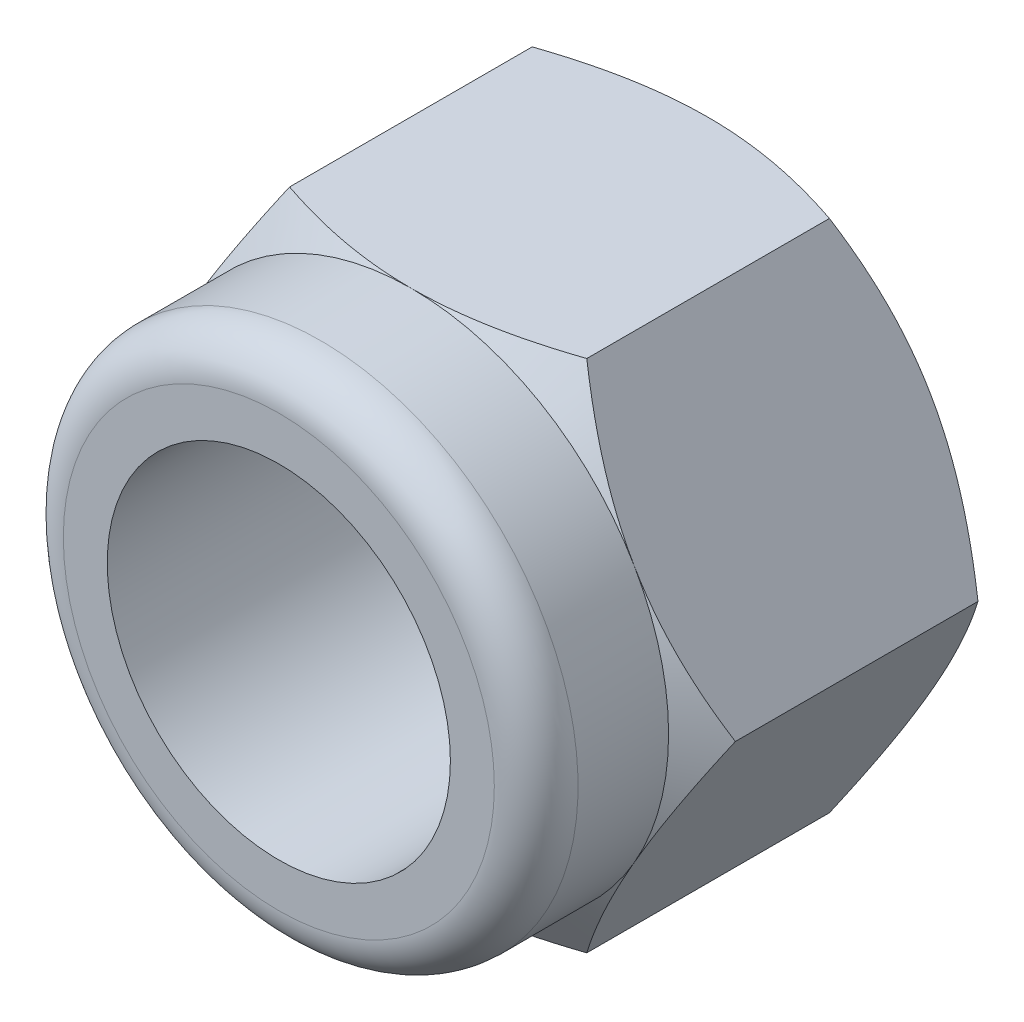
ISO-10303-21;
HEADER;
FILE_DESCRIPTION(('STEP AP214'),'2;1');
FILE_NAME('part.step','',(''),(''),'','','');
FILE_SCHEMA(('AUTOMOTIVE_DESIGN { 1 0 10303 214 1 1 1 1 }'));
ENDSEC;
DATA;
#1=APPLICATION_CONTEXT('core data for automotive mechanical design processes');
#2=APPLICATION_PROTOCOL_DEFINITION('international standard','automotive_design',2000,#1);
#3=PRODUCT_CONTEXT('',#1,'mechanical');
#4=PRODUCT('Part','Part','',(#3));
#5=PRODUCT_RELATED_PRODUCT_CATEGORY('part','',(#4));
#6=PRODUCT_DEFINITION_FORMATION('','',#4);
#7=PRODUCT_DEFINITION_CONTEXT('part definition',#1,'design');
#8=PRODUCT_DEFINITION('design','',#6,#7);
#9=PRODUCT_DEFINITION_SHAPE('','',#8);
#10=(LENGTH_UNIT() NAMED_UNIT(*) SI_UNIT(.MILLI.,.METRE.));
#11=(NAMED_UNIT(*) PLANE_ANGLE_UNIT() SI_UNIT($,.RADIAN.));
#12=(NAMED_UNIT(*) SI_UNIT($,.STERADIAN.) SOLID_ANGLE_UNIT());
#13=UNCERTAINTY_MEASURE_WITH_UNIT(LENGTH_MEASURE(1.E-05),#10,'distance_accuracy_value','');
#14=(GEOMETRIC_REPRESENTATION_CONTEXT(3) GLOBAL_UNCERTAINTY_ASSIGNED_CONTEXT((#13)) GLOBAL_UNIT_ASSIGNED_CONTEXT((#10,
#11,#12)) REPRESENTATION_CONTEXT('',''));
#15=CARTESIAN_POINT('',(0.,0.,0.));
#16=DIRECTION('',(0.,0.,1.));
#17=DIRECTION('',(1.,0.,0.));
#18=AXIS2_PLACEMENT_3D('',#15,#16,#17);
#19=CARTESIAN_POINT('',(-10.3923048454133,0.,10.37));
#20=DIRECTION('',(0.86602540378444,-0.499999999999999,0.));
#21=DIRECTION('',(0.499999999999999,0.86602540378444,0.));
#22=AXIS2_PLACEMENT_3D('',#19,#20,#21);
#23=PLANE('',#22);
#24=CARTESIAN_POINT('',(-10.3924203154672,-0.000200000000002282,9.42719454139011));
#25=CARTESIAN_POINT('',(-10.2764029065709,0.200748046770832,9.5057421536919));
#26=CARTESIAN_POINT('',(-10.1597703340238,0.402761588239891,9.58078081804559));
#27=CARTESIAN_POINT('',(-9.92519945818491,0.809050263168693,9.72275951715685));
#28=CARTESIAN_POINT('',(-9.80726035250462,1.01332678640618,9.78969423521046));
#29=CARTESIAN_POINT('',(-9.56974021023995,1.42472374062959,9.91449543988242));
#30=CARTESIAN_POINT('',(-9.45015489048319,1.63185159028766,9.97232958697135));
#31=CARTESIAN_POINT('',(-9.20985935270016,2.04805567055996,10.0774315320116));
#32=CARTESIAN_POINT('',(-9.08914949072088,2.25713128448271,10.1247025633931));
#33=CARTESIAN_POINT('',(-8.85083681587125,2.66990094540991,10.2061503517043));
#34=CARTESIAN_POINT('',(-8.73326753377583,2.87353691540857,10.2407169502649));
#35=CARTESIAN_POINT('',(-8.49740229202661,3.28206749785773,10.2980508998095));
#36=CARTESIAN_POINT('',(-8.37910631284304,3.4869621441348,10.3208179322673));
#37=CARTESIAN_POINT('',(-8.14228994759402,3.89714012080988,10.3538759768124));
#38=CARTESIAN_POINT('',(-8.02377034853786,4.10242208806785,10.3641893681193));
#39=CARTESIAN_POINT('',(-7.78662856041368,4.51316371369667,10.3721053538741));
#40=CARTESIAN_POINT('',(-7.66800637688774,4.71862336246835,10.3697085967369));
#41=CARTESIAN_POINT('',(-7.45072742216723,5.09496155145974,10.353732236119));
#42=CARTESIAN_POINT('',(-7.3520339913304,5.2659035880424,10.3420804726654));
#43=CARTESIAN_POINT('',(-7.15498835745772,5.60719663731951,10.3102495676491));
#44=CARTESIAN_POINT('',(-7.05663618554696,5.7775475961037,10.2900696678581));
#45=CARTESIAN_POINT('',(-6.76211080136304,6.28768052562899,10.2172283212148));
#46=CARTESIAN_POINT('',(-6.56667274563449,6.62618916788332,10.1522815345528));
#47=CARTESIAN_POINT('',(-6.17303719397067,7.30798594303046,9.99174825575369));
#48=CARTESIAN_POINT('',(-5.97492949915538,7.65111853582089,9.89531098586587));
#49=CARTESIAN_POINT('',(-5.58263770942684,8.33058784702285,9.67812469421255));
#50=CARTESIAN_POINT('',(-5.38844426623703,8.66694075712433,9.55744375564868));
#51=CARTESIAN_POINT('',(-5.1960369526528,9.00020000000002,9.42719454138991));
#52=B_SPLINE_CURVE_WITH_KNOTS('',3,(#24,#25,#26,#27,#28,#29,#30,#31,#32,#33,#34,#35,#36,#37,#38,
#39,#40,#41,#42,#43,#44,#45,#46,#47,#48,#49,#50,#51),.UNSPECIFIED.,.F.,.F.,(4,2,2,2,2,2,2,2,2,2,
2,2,2,4),(0.,0.734939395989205,1.47035837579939,2.20833441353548,2.94608424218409,
3.65880420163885,4.37154339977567,5.08299988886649,5.79442008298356,6.38742131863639,
6.98047528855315,8.16780437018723,9.39031146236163,10.6094322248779),.UNSPECIFIED.);
#53=CARTESIAN_POINT('',(-10.3923048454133,0.,9.42727272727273));
#54=VERTEX_POINT('',#53);
#55=CARTESIAN_POINT('',(-7.79422863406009,4.5,10.37));
#56=VERTEX_POINT('',#55);
#57=EDGE_CURVE('E142',#54,#56,#52,.T.);
#58=ORIENTED_EDGE('',*,*,#57,.T.);
#59=CARTESIAN_POINT('',(-5.19615242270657,8.99999999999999,9.42727272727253));
#60=VERTEX_POINT('',#59);
#61=EDGE_CURVE('E148',#56,#60,#52,.T.);
#62=ORIENTED_EDGE('',*,*,#61,.T.);
#63=DIRECTION('',(0.,0.,-1.));
#64=VECTOR('',#63,1.);
#65=CARTESIAN_POINT('',(-5.19615242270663,8.99999999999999,10.3699999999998));
#66=LINE('',#65,#64);
#67=CARTESIAN_POINT('',(-5.19615242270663,8.99999999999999,0.942727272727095));
#68=VERTEX_POINT('',#67);
#69=EDGE_CURVE('E232',#60,#68,#66,.T.);
#70=ORIENTED_EDGE('',*,*,#69,.T.);
#71=CARTESIAN_POINT('',(-5.1960369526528,9.00020000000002,0.942805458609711));
#72=CARTESIAN_POINT('',(-5.31205436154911,8.79925195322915,0.864257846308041));
#73=CARTESIAN_POINT('',(-5.42868693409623,8.59723841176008,0.789219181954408));
#74=CARTESIAN_POINT('',(-5.66325780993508,8.19094973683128,0.647240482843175));
#75=CARTESIAN_POINT('',(-5.78119691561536,7.9866732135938,0.580305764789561));
#76=CARTESIAN_POINT('',(-6.01871705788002,7.5752762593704,0.455504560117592));
#77=CARTESIAN_POINT('',(-6.13830237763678,7.36814840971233,0.397670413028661));
#78=CARTESIAN_POINT('',(-6.37859791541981,6.95194432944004,0.292568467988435));
#79=CARTESIAN_POINT('',(-6.49930777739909,6.74286871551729,0.245297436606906));
#80=CARTESIAN_POINT('',(-6.73762045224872,6.3300990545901,0.163849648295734));
#81=CARTESIAN_POINT('',(-6.85518973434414,6.12646308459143,0.129283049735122));
#82=CARTESIAN_POINT('',(-7.09105497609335,5.71793250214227,0.0719491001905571));
#83=CARTESIAN_POINT('',(-7.20935095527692,5.51303785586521,0.0491820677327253));
#84=CARTESIAN_POINT('',(-7.44616732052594,5.10285987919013,0.0161240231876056));
#85=CARTESIAN_POINT('',(-7.56468691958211,4.89757791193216,0.00581063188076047));
#86=CARTESIAN_POINT('',(-7.80182870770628,4.48683628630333,-0.00210535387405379));
#87=CARTESIAN_POINT('',(-7.92045089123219,4.28137663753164,0.00029140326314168));
#88=CARTESIAN_POINT('',(-8.1377298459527,3.90503844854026,0.0162677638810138));
#89=CARTESIAN_POINT('',(-8.23642327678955,3.73409641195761,0.0279195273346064));
#90=CARTESIAN_POINT('',(-8.43346891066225,3.39280336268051,0.0597504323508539));
#91=CARTESIAN_POINT('',(-8.531821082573,3.22245240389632,0.0799303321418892));
#92=CARTESIAN_POINT('',(-8.82634646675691,2.71231947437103,0.152771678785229));
#93=CARTESIAN_POINT('',(-9.02178452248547,2.3738108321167,0.217718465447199));
#94=CARTESIAN_POINT('',(-9.41542007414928,1.69201405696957,0.378251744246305));
#95=CARTESIAN_POINT('',(-9.61352776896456,1.34888146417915,0.474689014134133));
#96=CARTESIAN_POINT('',(-10.0058195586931,0.669412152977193,0.691875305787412));
#97=CARTESIAN_POINT('',(-10.2000130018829,0.33305924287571,0.81255624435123));
#98=CARTESIAN_POINT('',(-10.3924203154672,-0.000200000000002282,0.942805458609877));
#99=B_SPLINE_CURVE_WITH_KNOTS('',3,(#71,#72,#73,#74,#75,#76,#77,#78,#79,#80,#81,#82,#83,#84,#85,
#86,#87,#88,#89,#90,#91,#92,#93,#94,#95,#96,#97,#98),.UNSPECIFIED.,.F.,.F.,(4,2,2,2,2,2,2,2,2,2,
2,2,2,4),(0.,0.734939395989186,1.47035837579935,2.20833441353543,2.94608424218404,
3.65880420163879,4.37154339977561,5.08299988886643,5.79442008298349,6.38742131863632,
6.98047528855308,8.16780437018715,9.39031146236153,10.6094322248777),.UNSPECIFIED.);
#100=CARTESIAN_POINT('',(-7.79422863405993,4.49999999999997,0.));
#101=VERTEX_POINT('',#100);
#102=EDGE_CURVE('E231',#68,#101,#99,.T.);
#103=ORIENTED_EDGE('',*,*,#102,.T.);
#104=CARTESIAN_POINT('',(-10.3923048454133,0.,0.942727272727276));
#105=VERTEX_POINT('',#104);
#106=EDGE_CURVE('E225',#101,#105,#99,.T.);
#107=ORIENTED_EDGE('',*,*,#106,.T.);
#108=DIRECTION('',(0.,0.,-1.));
#109=VECTOR('',#108,1.);
#110=CARTESIAN_POINT('',(-10.3923048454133,0.,10.37));
#111=LINE('',#110,#109);
#112=EDGE_CURVE('E241',#54,#105,#111,.T.);
#113=ORIENTED_EDGE('',*,*,#112,.F.);
#114=EDGE_LOOP('',(#58,#62,#70,#103,#107,#113));
#115=FACE_BOUND('',#114,.T.);
#116=ADVANCED_FACE('F31',(#115),#23,.F.);
#117=CARTESIAN_POINT('',(-5.19615242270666,-9.00000000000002,10.3699999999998));
#118=DIRECTION('',(0.866025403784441,0.499999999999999,0.));
#119=DIRECTION('',(-0.499999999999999,0.866025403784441,0.));
#120=AXIS2_PLACEMENT_3D('',#117,#118,#119);
#121=PLANE('',#120);
#122=CARTESIAN_POINT('',(-5.19603695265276,-9.00020000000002,9.42719454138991));
#123=CARTESIAN_POINT('',(-5.31205436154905,-8.79925195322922,9.50574215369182));
#124=CARTESIAN_POINT('',(-5.42868693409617,-8.59723841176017,9.58078081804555));
#125=CARTESIAN_POINT('',(-5.66325780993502,-8.19094973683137,9.72275951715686));
#126=CARTESIAN_POINT('',(-5.7811969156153,-7.98667321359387,9.78969423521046));
#127=CARTESIAN_POINT('',(-6.01871705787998,-7.57527625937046,9.91449543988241));
#128=CARTESIAN_POINT('',(-6.13830237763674,-7.36814840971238,9.97232958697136));
#129=CARTESIAN_POINT('',(-6.37859791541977,-6.95194432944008,10.0774315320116));
#130=CARTESIAN_POINT('',(-6.49930777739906,-6.74286871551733,10.1247025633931));
#131=CARTESIAN_POINT('',(-6.73762045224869,-6.33009905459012,10.2061503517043));
#132=CARTESIAN_POINT('',(-6.85518973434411,-6.12646308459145,10.2407169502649));
#133=CARTESIAN_POINT('',(-7.09105497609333,-5.71793250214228,10.2980508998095));
#134=CARTESIAN_POINT('',(-7.20935095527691,-5.51303785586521,10.3208179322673));
#135=CARTESIAN_POINT('',(-7.44616732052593,-5.10285987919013,10.3538759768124));
#136=CARTESIAN_POINT('',(-7.5646869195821,-4.89757791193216,10.3641893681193));
#137=CARTESIAN_POINT('',(-7.80182870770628,-4.48683628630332,10.3721053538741));
#138=CARTESIAN_POINT('',(-7.9204508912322,-4.28137663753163,10.3697085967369));
#139=CARTESIAN_POINT('',(-8.13772984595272,-3.90503844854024,10.353732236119));
#140=CARTESIAN_POINT('',(-8.23642327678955,-3.73409641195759,10.3420804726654));
#141=CARTESIAN_POINT('',(-8.43346891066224,-3.39280336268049,10.3102495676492));
#142=CARTESIAN_POINT('',(-8.531821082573,-3.22245240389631,10.2900696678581));
#143=CARTESIAN_POINT('',(-8.8263464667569,-2.71231947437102,10.2172283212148));
#144=CARTESIAN_POINT('',(-9.02178452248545,-2.3738108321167,10.1522815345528));
#145=CARTESIAN_POINT('',(-9.41542007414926,-1.69201405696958,9.99174825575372));
#146=CARTESIAN_POINT('',(-9.61352776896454,-1.34888146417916,9.8953109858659));
#147=CARTESIAN_POINT('',(-10.0058195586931,-0.669412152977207,9.67812469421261));
#148=CARTESIAN_POINT('',(-10.2000130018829,-0.333059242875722,9.55744375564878));
#149=CARTESIAN_POINT('',(-10.3924203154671,0.000199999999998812,9.42719454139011));
#150=B_SPLINE_CURVE_WITH_KNOTS('',3,(#122,#123,#124,#125,#126,#127,#128,#129,#130,#131,#132,
#133,#134,#135,#136,#137,#138,#139,#140,#141,#142,#143,#144,#145,#146,#147,#148,#149),
.UNSPECIFIED.,.F.,.F.,(4,2,2,2,2,2,2,2,2,2,2,2,2,4),(0.,0.734939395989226,1.47035837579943,
2.20833441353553,2.94608424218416,3.65880420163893,4.37154339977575,5.08299988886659,
5.79442008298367,6.38742131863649,6.98047528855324,8.16780437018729,9.39031146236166,
10.6094322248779),.UNSPECIFIED.);
#151=CARTESIAN_POINT('',(-5.19615242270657,-9.00000000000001,9.42727272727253));
#152=VERTEX_POINT('',#151);
#153=CARTESIAN_POINT('',(-7.79422863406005,-4.50000000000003,10.37));
#154=VERTEX_POINT('',#153);
#155=EDGE_CURVE('E196',#152,#154,#150,.T.);
#156=ORIENTED_EDGE('',*,*,#155,.T.);
#157=EDGE_CURVE('E191',#154,#54,#150,.T.);
#158=ORIENTED_EDGE('',*,*,#157,.T.);
#159=ORIENTED_EDGE('',*,*,#112,.T.);
#160=CARTESIAN_POINT('',(-10.3924203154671,0.000199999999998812,0.942805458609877));
#161=CARTESIAN_POINT('',(-10.2764029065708,-0.200748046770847,0.864257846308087));
#162=CARTESIAN_POINT('',(-10.1597703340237,-0.402761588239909,0.789219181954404));
#163=CARTESIAN_POINT('',(-9.92519945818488,-0.809050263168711,0.647240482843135));
#164=CARTESIAN_POINT('',(-9.8072603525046,-1.0133267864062,0.580305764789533));
#165=CARTESIAN_POINT('',(-9.56974021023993,-1.4247237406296,0.455504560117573));
#166=CARTESIAN_POINT('',(-9.45015489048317,-1.63185159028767,0.397670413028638));
#167=CARTESIAN_POINT('',(-9.20985935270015,-2.04805567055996,0.292568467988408));
#168=CARTESIAN_POINT('',(-9.08914949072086,-2.25713128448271,0.245297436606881));
#169=CARTESIAN_POINT('',(-8.85083681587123,-2.66990094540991,0.16384964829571));
#170=CARTESIAN_POINT('',(-8.73326753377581,-2.87353691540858,0.129283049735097));
#171=CARTESIAN_POINT('',(-8.49740229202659,-3.28206749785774,0.0719491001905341));
#172=CARTESIAN_POINT('',(-8.37910631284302,-3.48696214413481,0.0491820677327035));
#173=CARTESIAN_POINT('',(-8.142289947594,-3.89714012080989,0.016124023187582));
#174=CARTESIAN_POINT('',(-8.02377034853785,-4.10242208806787,0.00581063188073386));
#175=CARTESIAN_POINT('',(-7.78662856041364,-4.51316371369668,-0.00210535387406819));
#176=CARTESIAN_POINT('',(-7.66800637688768,-4.71862336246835,0.000291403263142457));
#177=CARTESIAN_POINT('',(-7.45072742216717,-5.09496155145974,0.0162677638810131));
#178=CARTESIAN_POINT('',(-7.35203399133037,-5.26590358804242,0.0279195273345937));
#179=CARTESIAN_POINT('',(-7.15498835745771,-5.60719663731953,0.0597504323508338));
#180=CARTESIAN_POINT('',(-7.05663618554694,-5.77754759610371,0.0799303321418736));
#181=CARTESIAN_POINT('',(-6.76211080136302,-6.28768052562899,0.152771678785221));
#182=CARTESIAN_POINT('',(-6.56667274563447,-6.62618916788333,0.217718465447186));
#183=CARTESIAN_POINT('',(-6.17303719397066,-7.30798594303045,0.378251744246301));
#184=CARTESIAN_POINT('',(-5.97492949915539,-7.65111853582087,0.474689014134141));
#185=CARTESIAN_POINT('',(-5.58263770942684,-8.33058784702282,0.691875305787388));
#186=CARTESIAN_POINT('',(-5.38844426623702,-8.66694075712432,0.81255624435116));
#187=CARTESIAN_POINT('',(-5.19603695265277,-9.00020000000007,0.942805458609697));
#188=B_SPLINE_CURVE_WITH_KNOTS('',3,(#160,#161,#162,#163,#164,#165,#166,#167,#168,#169,#170,
#171,#172,#173,#174,#175,#176,#177,#178,#179,#180,#181,#182,#183,#184,#185,#186,#187),
.UNSPECIFIED.,.F.,.F.,(4,2,2,2,2,2,2,2,2,2,2,2,2,4),(0.,0.734939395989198,1.47035837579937,
2.20833441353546,2.94608424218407,3.65880420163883,4.37154339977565,5.08299988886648,
5.79442008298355,6.38742131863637,6.98047528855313,8.1678043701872,9.39031146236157,
10.6094322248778),.UNSPECIFIED.);
#189=CARTESIAN_POINT('',(-7.79422863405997,-4.49999999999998,0.));
#190=VERTEX_POINT('',#189);
#191=EDGE_CURVE('E218',#105,#190,#188,.T.);
#192=ORIENTED_EDGE('',*,*,#191,.T.);
#193=CARTESIAN_POINT('',(-5.19615242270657,-9.00000000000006,0.942727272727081));
#194=VERTEX_POINT('',#193);
#195=EDGE_CURVE('E211',#190,#194,#188,.T.);
#196=ORIENTED_EDGE('',*,*,#195,.T.);
#197=DIRECTION('',(0.,0.,-1.));
#198=VECTOR('',#197,1.);
#199=CARTESIAN_POINT('',(-5.19615242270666,-9.00000000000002,10.3699999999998));
#200=LINE('',#199,#198);
#201=EDGE_CURVE('E239',#152,#194,#200,.T.);
#202=ORIENTED_EDGE('',*,*,#201,.F.);
#203=EDGE_LOOP('',(#156,#158,#159,#192,#196,#202));
#204=FACE_BOUND('',#203,.T.);
#205=ADVANCED_FACE('F203',(#204),#121,.F.);
#206=CARTESIAN_POINT('',(5.19615242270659,-9.00000000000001,10.37));
#207=DIRECTION('',(0.,1.,0.));
#208=DIRECTION('',(-1.,0.,0.));
#209=AXIS2_PLACEMENT_3D('',#206,#207,#208);
#210=PLANE('',#209);
#211=CARTESIAN_POINT('',(-12.9103705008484,-8.99999999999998,5.80786161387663));
#212=CARTESIAN_POINT('',(-12.5576292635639,-8.99999999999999,6.00374062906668));
#213=CARTESIAN_POINT('',(-12.2038017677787,-9.,6.19769714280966));
#214=CARTESIAN_POINT('',(-11.4934395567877,-9.,6.58074550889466));
#215=CARTESIAN_POINT('',(-11.136904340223,-9.,6.76983643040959));
#216=CARTESIAN_POINT('',(-10.4184762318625,-9.,7.14322782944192));
#217=CARTESIAN_POINT('',(-10.0565637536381,-9.,7.32749075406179));
#218=CARTESIAN_POINT('',(-9.32901716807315,-9.,7.68849112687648));
#219=CARTESIAN_POINT('',(-8.96338326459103,-9.,7.86522898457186));
#220=CARTESIAN_POINT('',(-8.21373387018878,-9.,8.21580595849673));
#221=CARTESIAN_POINT('',(-7.82954714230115,-9.,8.38928095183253));
#222=CARTESIAN_POINT('',(-7.05549322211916,-9.,8.72328625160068));
#223=CARTESIAN_POINT('',(-6.66562533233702,-9.,8.88381495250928));
#224=CARTESIAN_POINT('',(-5.88027468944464,-9.,9.18786206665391));
#225=CARTESIAN_POINT('',(-5.4848069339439,-8.99999999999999,9.33141880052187));
#226=CARTESIAN_POINT('',(-4.68685985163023,-9.00000000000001,9.59722561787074));
#227=CARTESIAN_POINT('',(-4.28438300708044,-9.00000000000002,9.71948308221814));
#228=CARTESIAN_POINT('',(-3.44391502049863,-9.00000000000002,9.94465852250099));
#229=CARTESIAN_POINT('',(-3.00539253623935,-9.00000000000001,10.0456546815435));
#230=CARTESIAN_POINT('',(-2.34237770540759,-9.,10.1686377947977));
#231=CARTESIAN_POINT('',(-2.1204902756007,-9.,10.2048813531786));
#232=CARTESIAN_POINT('',(-1.67528917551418,-9.,10.2670774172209));
#233=CARTESIAN_POINT('',(-1.4519757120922,-9.,10.2930313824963));
#234=CARTESIAN_POINT('',(-1.00791822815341,-9.,10.3336849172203));
#235=CARTESIAN_POINT('',(-0.787190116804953,-9.,10.3485575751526));
#236=CARTESIAN_POINT('',(-0.345267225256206,-9.,10.3673453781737));
#237=CARTESIAN_POINT('',(-0.124072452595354,-9.00000000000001,10.3712606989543));
#238=CARTESIAN_POINT('',(0.318257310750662,-9.,10.3680301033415));
#239=CARTESIAN_POINT('',(0.539392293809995,-9.,10.3608831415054));
#240=CARTESIAN_POINT('',(0.98104140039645,-9.00000000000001,10.3357146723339));
#241=CARTESIAN_POINT('',(1.20155550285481,-9.00000000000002,10.3176928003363));
#242=CARTESIAN_POINT('',(1.68151380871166,-9.00000000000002,10.2669899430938));
#243=CARTESIAN_POINT('',(1.9407404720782,-9.00000000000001,10.2322382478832));
#244=CARTESIAN_POINT('',(2.45700905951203,-9.,10.1492778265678));
#245=CARTESIAN_POINT('',(2.71405082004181,-9.,10.1010681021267));
#246=CARTESIAN_POINT('',(3.48150607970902,-9.00000000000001,9.93822940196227));
#247=CARTESIAN_POINT('',(3.98812001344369,-9.00000000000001,9.80540581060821));
#248=CARTESIAN_POINT('',(4.74523791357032,-9.00000000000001,9.57660811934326));
#249=CARTESIAN_POINT('',(5.00008369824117,-9.00000000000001,9.4942797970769));
#250=CARTESIAN_POINT('',(5.50694625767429,-9.00000000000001,9.32126522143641));
#251=CARTESIAN_POINT('',(5.75896301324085,-9.00000000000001,9.23057891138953));
#252=CARTESIAN_POINT('',(6.26023528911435,-9.,9.04209996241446));
#253=CARTESIAN_POINT('',(6.50949145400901,-9.,8.94430902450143));
#254=CARTESIAN_POINT('',(7.00551982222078,-9.00000000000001,8.74264789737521));
#255=CARTESIAN_POINT('',(7.25229206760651,-9.00000000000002,8.63877781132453));
#256=CARTESIAN_POINT('',(7.88099884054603,-9.00000000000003,8.36630487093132));
#257=CARTESIAN_POINT('',(8.26132495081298,-9.00000000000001,8.19399300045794));
#258=CARTESIAN_POINT('',(9.01736070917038,-9.,7.83948874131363));
#259=CARTESIAN_POINT('',(9.3930698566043,-9.00000000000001,7.65729529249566));
#260=CARTESIAN_POINT('',(10.1407286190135,-9.00000000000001,7.28501367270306));
#261=CARTESIAN_POINT('',(10.5126766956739,-9.00000000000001,7.09492242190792));
#262=CARTESIAN_POINT('',(11.2532804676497,-9.00000000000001,6.70848256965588));
#263=CARTESIAN_POINT('',(11.6219362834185,-9.00000000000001,6.51213419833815));
#264=CARTESIAN_POINT('',(12.3571918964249,-9.00000000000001,6.11399000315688));
#265=CARTESIAN_POINT('',(12.7237864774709,-9.00000000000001,5.91218456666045));
#266=CARTESIAN_POINT('',(13.4546515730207,-9.00000000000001,5.50440899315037));
#267=CARTESIAN_POINT('',(13.818922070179,-9.00000000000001,5.29843882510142));
#268=CARTESIAN_POINT('',(14.5454133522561,-9.00000000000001,4.8831047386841));
#269=CARTESIAN_POINT('',(14.9076345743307,-9.00000000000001,4.67374158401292));
#270=CARTESIAN_POINT('',(15.6304021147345,-9.00000000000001,4.25214204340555));
#271=CARTESIAN_POINT('',(15.9909484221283,-9.00000000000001,4.03990563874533));
#272=CARTESIAN_POINT('',(16.9984655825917,-9.00000000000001,3.44227966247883));
#273=CARTESIAN_POINT('',(17.6438365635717,-9.00000000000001,3.05419305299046));
#274=CARTESIAN_POINT('',(18.9310696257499,-9.00000000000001,2.27217411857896));
#275=CARTESIAN_POINT('',(19.5729314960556,-9.00000000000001,1.87824144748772));
#276=CARTESIAN_POINT('',(20.8512085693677,-9.00000000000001,1.0875558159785));
#277=CARTESIAN_POINT('',(21.4876353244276,-9.00000000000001,0.690821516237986));
#278=CARTESIAN_POINT('',(22.4406078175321,-9.00000000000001,0.0931285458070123));
#279=CARTESIAN_POINT('',(22.7579732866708,-9.00000000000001,-0.106525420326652));
#280=CARTESIAN_POINT('',(23.392211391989,-9.00000000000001,-0.506612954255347));
#281=CARTESIAN_POINT('',(23.7090840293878,-9.00000000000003,-0.707046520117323));
#282=CARTESIAN_POINT('',(24.0257377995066,-9.00000000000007,-0.907825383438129));
#283=B_SPLINE_CURVE_WITH_KNOTS('',3,(#211,#212,#213,#214,#215,#216,#217,#218,#219,#220,#221,
#222,#223,#224,#225,#226,#227,#228,#229,#230,#231,#232,#233,#234,#235,#236,#237,#238,#239,#240,
#241,#242,#243,#244,#245,#246,#247,#248,#249,#250,#251,#252,#253,#254,#255,#256,#257,#258,#259,
#260,#261,#262,#263,#264,#265,#266,#267,#268,#269,#270,#271,#272,#273,#274,#275,#276,#277,#278,
#279,#280,#281,#282),.UNSPECIFIED.,.F.,.F.,(4,2,2,2,2,2,2,2,2,2,2,2,2,2,2,2,2,2,2,2,2,2,2,2,2,2,
2,2,2,2,2,2,2,2,2,4),(0.,1.21045408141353,2.42113803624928,3.63942702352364,4.85764962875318,
6.12207221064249,7.38665135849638,8.64831838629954,9.90954733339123,11.2579864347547,
11.9322698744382,12.6064576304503,13.26988021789,13.9332921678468,14.5967668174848,
15.2602637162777,16.0444931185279,16.8287807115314,18.3977454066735,19.2011028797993,
20.004465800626,20.8076370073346,21.6107945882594,22.8632166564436,24.115773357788,
25.3688231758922,26.621826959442,27.8772038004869,29.1325899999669,30.3876974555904,
31.64281309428,33.9019774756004,36.1612761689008,38.4111350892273,39.5359644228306,
40.6607909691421),.UNSPECIFIED.);
#284=CARTESIAN_POINT('',(5.19615242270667,-8.99999999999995,9.42727272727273));
#285=VERTEX_POINT('',#284);
#286=CARTESIAN_POINT('',(0.,-9.00000000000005,10.37));
#287=VERTEX_POINT('',#286);
#288=EDGE_CURVE('E288',#285,#287,#283,.F.);
#289=ORIENTED_EDGE('',*,*,#288,.T.);
#290=EDGE_CURVE('E197',#287,#152,#283,.F.);
#291=ORIENTED_EDGE('',*,*,#290,.T.);
#292=ORIENTED_EDGE('',*,*,#201,.T.);
#293=CARTESIAN_POINT('',(-12.9103705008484,-8.99999999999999,4.56213838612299));
#294=CARTESIAN_POINT('',(-12.5576292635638,-9.,4.36625937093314));
#295=CARTESIAN_POINT('',(-12.2038017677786,-9.,4.17230285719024));
#296=CARTESIAN_POINT('',(-11.4934395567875,-9.,3.7892544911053));
#297=CARTESIAN_POINT('',(-11.1369043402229,-9.,3.60016356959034));
#298=CARTESIAN_POINT('',(-10.4184762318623,-9.,3.226772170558));
#299=CARTESIAN_POINT('',(-10.0565637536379,-9.,3.04250924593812));
#300=CARTESIAN_POINT('',(-9.32901716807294,-9.,2.68150887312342));
#301=CARTESIAN_POINT('',(-8.96338326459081,-9.,2.50477101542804));
#302=CARTESIAN_POINT('',(-8.21373387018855,-9.,2.15419404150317));
#303=CARTESIAN_POINT('',(-7.82954714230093,-9.,1.98071904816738));
#304=CARTESIAN_POINT('',(-7.05549322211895,-9.,1.64671374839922));
#305=CARTESIAN_POINT('',(-6.66562533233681,-9.00000000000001,1.48618504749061));
#306=CARTESIAN_POINT('',(-5.88027468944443,-9.,1.18213793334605));
#307=CARTESIAN_POINT('',(-5.48480693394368,-8.99999999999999,1.03858119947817));
#308=CARTESIAN_POINT('',(-4.6868598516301,-9.00000000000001,0.772774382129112));
#309=CARTESIAN_POINT('',(-4.2843830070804,-9.00000000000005,0.650516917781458));
#310=CARTESIAN_POINT('',(-3.44391502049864,-9.00000000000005,0.425341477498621));
#311=CARTESIAN_POINT('',(-3.0053925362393,-9.00000000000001,0.324345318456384));
#312=CARTESIAN_POINT('',(-2.34237770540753,-9.,0.201362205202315));
#313=CARTESIAN_POINT('',(-2.12049027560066,-9.,0.165118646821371));
#314=CARTESIAN_POINT('',(-1.67528917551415,-9.00000000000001,0.102922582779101));
#315=CARTESIAN_POINT('',(-1.45197571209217,-9.,0.0769686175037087));
#316=CARTESIAN_POINT('',(-1.00791822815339,-9.,0.0363150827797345));
#317=CARTESIAN_POINT('',(-0.787190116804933,-9.,0.0214424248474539));
#318=CARTESIAN_POINT('',(-0.345267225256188,-9.,0.00265462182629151));
#319=CARTESIAN_POINT('',(-0.124072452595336,-9.00000000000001,-0.00126069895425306));
#320=CARTESIAN_POINT('',(0.318257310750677,-9.,0.00196989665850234));
#321=CARTESIAN_POINT('',(0.539392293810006,-9.,0.00911685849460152));
#322=CARTESIAN_POINT('',(0.981041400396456,-9.00000000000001,0.034285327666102));
#323=CARTESIAN_POINT('',(1.20155550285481,-9.00000000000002,0.0523071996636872));
#324=CARTESIAN_POINT('',(1.68151380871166,-9.00000000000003,0.103010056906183));
#325=CARTESIAN_POINT('',(1.9407404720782,-9.00000000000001,0.13776175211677));
#326=CARTESIAN_POINT('',(2.45700905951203,-9.,0.220722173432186));
#327=CARTESIAN_POINT('',(2.71405082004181,-9.,0.268931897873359));
#328=CARTESIAN_POINT('',(3.48150607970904,-9.00000000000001,0.431770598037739));
#329=CARTESIAN_POINT('',(3.98812001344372,-9.00000000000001,0.564594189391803));
#330=CARTESIAN_POINT('',(4.74523791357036,-9.00000000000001,0.793391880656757));
#331=CARTESIAN_POINT('',(5.00008369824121,-9.00000000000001,0.875720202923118));
#332=CARTESIAN_POINT('',(5.50694625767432,-9.00000000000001,1.04873477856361));
#333=CARTESIAN_POINT('',(5.75896301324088,-9.00000000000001,1.13942108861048));
#334=CARTESIAN_POINT('',(6.26023528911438,-9.,1.32790003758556));
#335=CARTESIAN_POINT('',(6.50949145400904,-9.,1.42569097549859));
#336=CARTESIAN_POINT('',(7.00551982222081,-9.00000000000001,1.6273521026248));
#337=CARTESIAN_POINT('',(7.25229206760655,-9.00000000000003,1.73122218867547));
#338=CARTESIAN_POINT('',(7.88099884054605,-9.00000000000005,2.00369512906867));
#339=CARTESIAN_POINT('',(8.26132495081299,-9.00000000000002,2.17600699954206));
#340=CARTESIAN_POINT('',(9.01736070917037,-9.,2.53051125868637));
#341=CARTESIAN_POINT('',(9.39306985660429,-9.,2.71270470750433));
#342=CARTESIAN_POINT('',(10.1407286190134,-9.00000000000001,3.08498632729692));
#343=CARTESIAN_POINT('',(10.5126766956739,-9.00000000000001,3.27507757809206));
#344=CARTESIAN_POINT('',(11.2532804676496,-9.00000000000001,3.66151743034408));
#345=CARTESIAN_POINT('',(11.6219362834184,-9.00000000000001,3.85786580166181));
#346=CARTESIAN_POINT('',(12.3571918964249,-9.00000000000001,4.25600999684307));
#347=CARTESIAN_POINT('',(12.7237864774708,-9.00000000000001,4.4578154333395));
#348=CARTESIAN_POINT('',(13.4546515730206,-9.00000000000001,4.86559100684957));
#349=CARTESIAN_POINT('',(13.8189220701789,-9.00000000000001,5.07156117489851));
#350=CARTESIAN_POINT('',(14.545413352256,-9.00000000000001,5.48689526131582));
#351=CARTESIAN_POINT('',(14.9076345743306,-9.00000000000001,5.696258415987));
#352=CARTESIAN_POINT('',(15.6304021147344,-9.00000000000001,6.11785795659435));
#353=CARTESIAN_POINT('',(15.9909484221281,-9.00000000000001,6.33009436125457));
#354=CARTESIAN_POINT('',(16.9984655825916,-9.00000000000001,6.92772033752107));
#355=CARTESIAN_POINT('',(17.6438365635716,-9.00000000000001,7.31580694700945));
#356=CARTESIAN_POINT('',(18.9310696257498,-9.00000000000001,8.09782588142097));
#357=CARTESIAN_POINT('',(19.5729314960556,-9.00000000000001,8.49175855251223));
#358=CARTESIAN_POINT('',(20.8512085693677,-9.00000000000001,9.28244418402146));
#359=CARTESIAN_POINT('',(21.4876353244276,-9.00000000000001,9.67917848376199));
#360=CARTESIAN_POINT('',(22.4406078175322,-9.00000000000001,10.276871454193));
#361=CARTESIAN_POINT('',(22.7579732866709,-9.00000000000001,10.4765254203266));
#362=CARTESIAN_POINT('',(23.392211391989,-9.00000000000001,10.8766129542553));
#363=CARTESIAN_POINT('',(23.7090840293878,-9.00000000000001,11.0770465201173));
#364=CARTESIAN_POINT('',(24.0257377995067,-9.00000000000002,11.2778253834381));
#365=B_SPLINE_CURVE_WITH_KNOTS('',3,(#293,#294,#295,#296,#297,#298,#299,#300,#301,#302,#303,
#304,#305,#306,#307,#308,#309,#310,#311,#312,#313,#314,#315,#316,#317,#318,#319,#320,#321,#322,
#323,#324,#325,#326,#327,#328,#329,#330,#331,#332,#333,#334,#335,#336,#337,#338,#339,#340,#341,
#342,#343,#344,#345,#346,#347,#348,#349,#350,#351,#352,#353,#354,#355,#356,#357,#358,#359,#360,
#361,#362,#363,#364),.UNSPECIFIED.,.F.,.F.,(4,2,2,2,2,2,2,2,2,2,2,2,2,2,2,2,2,2,2,2,2,2,2,2,2,2,
2,2,2,2,2,2,2,2,2,4),(0.,1.21045408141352,2.42113803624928,3.63942702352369,4.85764962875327,
6.12207221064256,7.38665135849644,8.64831838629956,9.90954733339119,11.2579864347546,
11.9322698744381,12.6064576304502,13.2698802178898,13.9332921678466,14.5967668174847,
15.2602637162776,16.0444931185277,16.8287807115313,18.3977454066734,19.2011028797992,
20.0044658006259,20.8076370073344,21.6107945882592,22.8632166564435,24.1157733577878,
25.368823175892,26.6218269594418,27.8772038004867,29.1325899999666,30.3876974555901,
31.6428130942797,33.9019774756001,36.1612761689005,38.4111350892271,39.5359644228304,
40.660790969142),.UNSPECIFIED.);
#366=CARTESIAN_POINT('',(0.,-9.00000000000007,0.));
#367=VERTEX_POINT('',#366);
#368=EDGE_CURVE('E219',#194,#367,#365,.T.);
#369=ORIENTED_EDGE('',*,*,#368,.T.);
#370=CARTESIAN_POINT('',(5.19615242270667,-8.99999999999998,0.942727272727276));
#371=VERTEX_POINT('',#370);
#372=EDGE_CURVE('E220',#367,#371,#365,.T.);
#373=ORIENTED_EDGE('',*,*,#372,.T.);
#374=DIRECTION('',(0.,0.,-1.));
#375=VECTOR('',#374,1.);
#376=CARTESIAN_POINT('',(5.19615242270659,-9.00000000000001,10.37));
#377=LINE('',#376,#375);
#378=EDGE_CURVE('E237',#285,#371,#377,.T.);
#379=ORIENTED_EDGE('',*,*,#378,.F.);
#380=EDGE_LOOP('',(#289,#291,#292,#369,#373,#379));
#381=FACE_BOUND('',#380,.T.);
#382=ADVANCED_FACE('F206',(#381),#210,.F.);
#383=CARTESIAN_POINT('',(10.3923048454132,0.,10.37));
#384=DIRECTION('',(-0.866025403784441,0.499999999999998,0.));
#385=DIRECTION('',(-0.499999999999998,-0.866025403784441,0.));
#386=AXIS2_PLACEMENT_3D('',#383,#384,#385);
#387=PLANE('',#386);
#388=CARTESIAN_POINT('',(10.392420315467,0.000199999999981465,9.42719454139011));
#389=CARTESIAN_POINT('',(10.2764029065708,-0.200748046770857,9.50574215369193));
#390=CARTESIAN_POINT('',(10.1597703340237,-0.402761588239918,9.58078081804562));
#391=CARTESIAN_POINT('',(9.92519945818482,-0.809050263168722,9.7227595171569));
#392=CARTESIAN_POINT('',(9.80726035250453,-1.01332678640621,9.7896942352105));
#393=CARTESIAN_POINT('',(9.56974021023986,-1.42472374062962,9.91449543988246));
#394=CARTESIAN_POINT('',(9.4501548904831,-1.63185159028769,9.97232958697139));
#395=CARTESIAN_POINT('',(9.20985935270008,-2.04805567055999,10.0774315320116));
#396=CARTESIAN_POINT('',(9.08914949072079,-2.25713128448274,10.1247025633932));
#397=CARTESIAN_POINT('',(8.85083681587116,-2.66990094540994,10.2061503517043));
#398=CARTESIAN_POINT('',(8.73326753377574,-2.87353691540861,10.2407169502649));
#399=CARTESIAN_POINT('',(8.49740229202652,-3.28206749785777,10.2980508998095));
#400=CARTESIAN_POINT('',(8.37910631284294,-3.48696214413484,10.3208179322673));
#401=CARTESIAN_POINT('',(8.14228994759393,-3.89714012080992,10.3538759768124));
#402=CARTESIAN_POINT('',(8.02377034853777,-4.1024220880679,10.3641893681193));
#403=CARTESIAN_POINT('',(7.78662856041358,-4.51316371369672,10.3721053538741));
#404=CARTESIAN_POINT('',(7.66800637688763,-4.7186233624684,10.3697085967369));
#405=CARTESIAN_POINT('',(7.45072742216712,-5.09496155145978,10.353732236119));
#406=CARTESIAN_POINT('',(7.35203399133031,-5.26590358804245,10.3420804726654));
#407=CARTESIAN_POINT('',(7.15498835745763,-5.60719663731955,10.3102495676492));
#408=CARTESIAN_POINT('',(7.05663618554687,-5.77754759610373,10.2900696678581));
#409=CARTESIAN_POINT('',(6.76211080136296,-6.28768052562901,10.2172283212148));
#410=CARTESIAN_POINT('',(6.56667274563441,-6.62618916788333,10.1522815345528));
#411=CARTESIAN_POINT('',(6.17303719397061,-7.30798594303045,9.99174825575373));
#412=CARTESIAN_POINT('',(5.97492949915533,-7.65111853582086,9.8953109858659));
#413=CARTESIAN_POINT('',(5.5826377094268,-8.33058784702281,9.67812469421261));
#414=CARTESIAN_POINT('',(5.388444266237,-8.66694075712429,9.55744375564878));
#415=CARTESIAN_POINT('',(5.19603695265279,-9.00020000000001,9.4271945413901));
#416=B_SPLINE_CURVE_WITH_KNOTS('',3,(#388,#389,#390,#391,#392,#393,#394,#395,#396,#397,#398,
#399,#400,#401,#402,#403,#404,#405,#406,#407,#408,#409,#410,#411,#412,#413,#414,#415),
.UNSPECIFIED.,.F.,.F.,(4,2,2,2,2,2,2,2,2,2,2,2,2,4),(0.,0.734939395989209,1.4703583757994,
2.20833441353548,2.9460842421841,3.65880420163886,4.37154339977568,5.08299988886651,
5.79442008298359,6.3874213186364,6.98047528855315,8.1678043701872,9.39031146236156,
10.6094322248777),.UNSPECIFIED.);
#417=CARTESIAN_POINT('',(10.3923048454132,0.,9.42727272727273));
#418=VERTEX_POINT('',#417);
#419=CARTESIAN_POINT('',(7.79422863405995,-4.50000000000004,10.37));
#420=VERTEX_POINT('',#419);
#421=EDGE_CURVE('E139',#418,#420,#416,.T.);
#422=ORIENTED_EDGE('',*,*,#421,.T.);
#423=EDGE_CURVE('E289',#420,#285,#416,.T.);
#424=ORIENTED_EDGE('',*,*,#423,.T.);
#425=ORIENTED_EDGE('',*,*,#378,.T.);
#426=CARTESIAN_POINT('',(5.19603695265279,-9.00020000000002,0.942805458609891));
#427=CARTESIAN_POINT('',(5.31205436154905,-8.79925195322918,0.864257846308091));
#428=CARTESIAN_POINT('',(5.42868693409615,-8.59723841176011,0.789219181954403));
#429=CARTESIAN_POINT('',(5.66325780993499,-8.19094973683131,0.647240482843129));
#430=CARTESIAN_POINT('',(5.78119691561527,-7.98667321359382,0.580305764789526));
#431=CARTESIAN_POINT('',(6.01871705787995,-7.57527625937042,0.455504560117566));
#432=CARTESIAN_POINT('',(6.1383023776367,-7.36814840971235,0.39767041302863));
#433=CARTESIAN_POINT('',(6.37859791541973,-6.95194432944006,0.2925684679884));
#434=CARTESIAN_POINT('',(6.49930777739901,-6.74286871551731,0.245297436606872));
#435=CARTESIAN_POINT('',(6.73762045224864,-6.33009905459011,0.1638496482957));
#436=CARTESIAN_POINT('',(6.85518973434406,-6.12646308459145,0.129283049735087));
#437=CARTESIAN_POINT('',(7.09105497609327,-5.71793250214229,0.0719491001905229));
#438=CARTESIAN_POINT('',(7.20935095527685,-5.51303785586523,0.0491820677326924));
#439=CARTESIAN_POINT('',(7.44616732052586,-5.10285987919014,0.0161240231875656));
#440=CARTESIAN_POINT('',(7.56468691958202,-4.89757791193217,0.00581063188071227));
#441=CARTESIAN_POINT('',(7.80182870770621,-4.48683628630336,-0.0021053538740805));
#442=CARTESIAN_POINT('',(7.92045089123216,-4.28137663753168,0.000291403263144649));
#443=CARTESIAN_POINT('',(8.13772984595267,-3.90503844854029,0.0162677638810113));
#444=CARTESIAN_POINT('',(8.23642327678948,-3.73409641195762,0.0279195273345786));
#445=CARTESIAN_POINT('',(8.43346891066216,-3.39280336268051,0.0597504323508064));
#446=CARTESIAN_POINT('',(8.53182108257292,-3.22245240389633,0.0799303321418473));
#447=CARTESIAN_POINT('',(8.82634646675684,-2.71231947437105,0.152771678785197));
#448=CARTESIAN_POINT('',(9.02178452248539,-2.37381083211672,0.217718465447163));
#449=CARTESIAN_POINT('',(9.4154200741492,-1.69201405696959,0.378251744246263));
#450=CARTESIAN_POINT('',(9.61352776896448,-1.34888146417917,0.474689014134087));
#451=CARTESIAN_POINT('',(10.005819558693,-0.669412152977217,0.691875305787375));
#452=CARTESIAN_POINT('',(10.2000130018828,-0.333059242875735,0.812556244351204));
#453=CARTESIAN_POINT('',(10.3924203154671,0.000199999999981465,0.942805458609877));
#454=B_SPLINE_CURVE_WITH_KNOTS('',3,(#426,#427,#428,#429,#430,#431,#432,#433,#434,#435,#436,
#437,#438,#439,#440,#441,#442,#443,#444,#445,#446,#447,#448,#449,#450,#451,#452,#453),
.UNSPECIFIED.,.F.,.F.,(4,2,2,2,2,2,2,2,2,2,2,2,2,4),(0.,0.7349393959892,1.47035837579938,
2.20833441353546,2.94608424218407,3.65880420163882,4.37154339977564,5.08299988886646,
5.79442008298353,6.38742131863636,6.98047528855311,8.16780437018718,9.39031146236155,
10.6094322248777),.UNSPECIFIED.);
#455=CARTESIAN_POINT('',(7.79422863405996,-4.50000000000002,0.));
#456=VERTEX_POINT('',#455);
#457=EDGE_CURVE('E306',#371,#456,#454,.T.);
#458=ORIENTED_EDGE('',*,*,#457,.T.);
#459=CARTESIAN_POINT('',(10.3923048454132,0.,0.942727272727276));
#460=VERTEX_POINT('',#459);
#461=EDGE_CURVE('E296',#456,#460,#454,.T.);
#462=ORIENTED_EDGE('',*,*,#461,.T.);
#463=DIRECTION('',(0.,0.,-1.));
#464=VECTOR('',#463,1.);
#465=CARTESIAN_POINT('',(10.3923048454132,0.,10.37));
#466=LINE('',#465,#464);
#467=EDGE_CURVE('E235',#418,#460,#466,.T.);
#468=ORIENTED_EDGE('',*,*,#467,.F.);
#469=EDGE_LOOP('',(#422,#424,#425,#458,#462,#468));
#470=FACE_BOUND('',#469,.T.);
#471=ADVANCED_FACE('F293',(#470),#387,.F.);
#472=CARTESIAN_POINT('',(5.19615242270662,9.,10.37));
#473=DIRECTION('',(-0.866025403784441,-0.499999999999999,0.));
#474=DIRECTION('',(0.499999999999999,-0.866025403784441,0.));
#475=AXIS2_PLACEMENT_3D('',#472,#473,#474);
#476=PLANE('',#475);
#477=CARTESIAN_POINT('',(5.19603695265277,9.00020000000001,9.4271945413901));
#478=CARTESIAN_POINT('',(5.31205436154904,8.79925195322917,9.5057421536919));
#479=CARTESIAN_POINT('',(5.42868693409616,8.5972384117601,9.58078081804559));
#480=CARTESIAN_POINT('',(5.663257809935,8.1909497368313,9.72275951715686));
#481=CARTESIAN_POINT('',(5.78119691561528,7.98667321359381,9.78969423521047));
#482=CARTESIAN_POINT('',(6.01871705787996,7.5752762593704,9.91449543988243));
#483=CARTESIAN_POINT('',(6.13830237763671,7.36814840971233,9.97232958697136));
#484=CARTESIAN_POINT('',(6.37859791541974,6.95194432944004,10.0774315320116));
#485=CARTESIAN_POINT('',(6.49930777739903,6.74286871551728,10.1247025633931));
#486=CARTESIAN_POINT('',(6.73762045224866,6.33009905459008,10.2061503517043));
#487=CARTESIAN_POINT('',(6.85518973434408,6.12646308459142,10.2407169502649));
#488=CARTESIAN_POINT('',(7.0910549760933,5.71793250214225,10.2980508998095));
#489=CARTESIAN_POINT('',(7.20935095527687,5.51303785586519,10.3208179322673));
#490=CARTESIAN_POINT('',(7.44616732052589,5.1028598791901,10.3538759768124));
#491=CARTESIAN_POINT('',(7.56468691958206,4.89757791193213,10.3641893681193));
#492=CARTESIAN_POINT('',(7.80182870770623,4.4868362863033,10.3721053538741));
#493=CARTESIAN_POINT('',(7.92045089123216,4.28137663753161,10.3697085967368));
#494=CARTESIAN_POINT('',(8.13772984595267,3.90503844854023,10.353732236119));
#495=CARTESIAN_POINT('',(8.23642327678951,3.73409641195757,10.3420804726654));
#496=CARTESIAN_POINT('',(8.4334689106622,3.39280336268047,10.3102495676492));
#497=CARTESIAN_POINT('',(8.53182108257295,3.22245240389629,10.2900696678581));
#498=CARTESIAN_POINT('',(8.82634646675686,2.712319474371,10.2172283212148));
#499=CARTESIAN_POINT('',(9.02178452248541,2.37381083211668,10.1522815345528));
#500=CARTESIAN_POINT('',(9.41542007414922,1.69201405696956,9.99174825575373));
#501=CARTESIAN_POINT('',(9.6135277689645,1.34888146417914,9.8953109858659));
#502=CARTESIAN_POINT('',(10.005819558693,0.66941215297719,9.67812469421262));
#503=CARTESIAN_POINT('',(10.2000130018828,0.333059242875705,9.55744375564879));
#504=CARTESIAN_POINT('',(10.392420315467,-0.000200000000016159,9.42719454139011));
#505=B_SPLINE_CURVE_WITH_KNOTS('',3,(#477,#478,#479,#480,#481,#482,#483,#484,#485,#486,#487,
#488,#489,#490,#491,#492,#493,#494,#495,#496,#497,#498,#499,#500,#501,#502,#503,#504),
.UNSPECIFIED.,.F.,.F.,(4,2,2,2,2,2,2,2,2,2,2,2,2,4),(0.,0.734939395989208,1.47035837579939,
2.20833441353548,2.9460842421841,3.65880420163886,4.37154339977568,5.08299988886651,
5.79442008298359,6.38742131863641,6.98047528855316,8.16780437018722,9.39031146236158,
10.6094322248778),.UNSPECIFIED.);
#506=CARTESIAN_POINT('',(5.19615242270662,9.,9.4272727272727));
#507=VERTEX_POINT('',#506);
#508=CARTESIAN_POINT('',(7.79422863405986,4.49999999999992,10.37));
#509=VERTEX_POINT('',#508);
#510=EDGE_CURVE('E46',#507,#509,#505,.T.);
#511=ORIENTED_EDGE('',*,*,#510,.T.);
#512=EDGE_CURVE('E137',#509,#418,#505,.T.);
#513=ORIENTED_EDGE('',*,*,#512,.T.);
#514=ORIENTED_EDGE('',*,*,#467,.T.);
#515=CARTESIAN_POINT('',(10.392420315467,-0.000200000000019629,0.942805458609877));
#516=CARTESIAN_POINT('',(10.2764029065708,0.20074804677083,0.864257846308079));
#517=CARTESIAN_POINT('',(10.1597703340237,0.402761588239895,0.789219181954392));
#518=CARTESIAN_POINT('',(9.92519945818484,0.809050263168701,0.64724048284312));
#519=CARTESIAN_POINT('',(9.80726035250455,1.01332678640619,0.580305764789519));
#520=CARTESIAN_POINT('',(9.56974021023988,1.42472374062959,0.45550456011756));
#521=CARTESIAN_POINT('',(9.45015489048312,1.63185159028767,0.397670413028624));
#522=CARTESIAN_POINT('',(9.20985935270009,2.04805567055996,0.292568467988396));
#523=CARTESIAN_POINT('',(9.08914949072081,2.25713128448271,0.245297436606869));
#524=CARTESIAN_POINT('',(8.85083681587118,2.66990094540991,0.1638496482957));
#525=CARTESIAN_POINT('',(8.73326753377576,2.87353691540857,0.129283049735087));
#526=CARTESIAN_POINT('',(8.49740229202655,3.28206749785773,0.0719491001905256));
#527=CARTESIAN_POINT('',(8.37910631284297,3.4869621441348,0.0491820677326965));
#528=CARTESIAN_POINT('',(8.14228994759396,3.89714012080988,0.0161240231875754));
#529=CARTESIAN_POINT('',(8.02377034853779,4.10242208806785,0.00581063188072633));
#530=CARTESIAN_POINT('',(7.78662856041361,4.51316371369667,-0.00210535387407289));
#531=CARTESIAN_POINT('',(7.66800637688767,4.71862336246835,0.000291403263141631));
#532=CARTESIAN_POINT('',(7.45072742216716,5.09496155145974,0.0162677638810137));
#533=CARTESIAN_POINT('',(7.35203399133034,5.26590358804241,0.027919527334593));
#534=CARTESIAN_POINT('',(7.15498835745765,5.60719663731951,0.0597504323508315));
#535=CARTESIAN_POINT('',(7.05663618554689,5.77754759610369,0.0799303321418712));
#536=CARTESIAN_POINT('',(6.76211080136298,6.28768052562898,0.15277167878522));
#537=CARTESIAN_POINT('',(6.56667274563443,6.62618916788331,0.21771846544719));
#538=CARTESIAN_POINT('',(6.17303719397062,7.30798594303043,0.378251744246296));
#539=CARTESIAN_POINT('',(5.97492949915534,7.65111853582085,0.474689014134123));
#540=CARTESIAN_POINT('',(5.5826377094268,8.33058784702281,0.691875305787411));
#541=CARTESIAN_POINT('',(5.38844426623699,8.66694075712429,0.812556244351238));
#542=CARTESIAN_POINT('',(5.19603695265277,9.00020000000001,0.942805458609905));
#543=B_SPLINE_CURVE_WITH_KNOTS('',3,(#515,#516,#517,#518,#519,#520,#521,#522,#523,#524,#525,
#526,#527,#528,#529,#530,#531,#532,#533,#534,#535,#536,#537,#538,#539,#540,#541,#542),
.UNSPECIFIED.,.F.,.F.,(4,2,2,2,2,2,2,2,2,2,2,2,2,4),(0.,0.734939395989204,1.47035837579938,
2.20833441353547,2.94608424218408,3.65880420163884,4.37154339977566,5.08299988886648,
5.79442008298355,6.38742131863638,6.98047528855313,8.1678043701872,9.39031146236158,
10.6094322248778),.UNSPECIFIED.);
#544=CARTESIAN_POINT('',(7.79422863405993,4.49999999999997,0.));
#545=VERTEX_POINT('',#544);
#546=EDGE_CURVE('E299',#460,#545,#543,.T.);
#547=ORIENTED_EDGE('',*,*,#546,.T.);
#548=CARTESIAN_POINT('',(5.19615242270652,9.00000000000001,0.942727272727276));
#549=VERTEX_POINT('',#548);
#550=EDGE_CURVE('E304',#545,#549,#543,.T.);
#551=ORIENTED_EDGE('',*,*,#550,.T.);
#552=DIRECTION('',(0.,0.,-1.));
#553=VECTOR('',#552,1.);
#554=CARTESIAN_POINT('',(5.19615242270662,9.,10.37));
#555=LINE('',#554,#553);
#556=EDGE_CURVE('E147',#507,#549,#555,.T.);
#557=ORIENTED_EDGE('',*,*,#556,.F.);
#558=EDGE_LOOP('',(#511,#513,#514,#547,#551,#557));
#559=FACE_BOUND('',#558,.T.);
#560=ADVANCED_FACE('F145',(#559),#476,.F.);
#561=CARTESIAN_POINT('',(-5.19615242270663,8.99999999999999,10.3699999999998));
#562=DIRECTION('',(0.,-1.,0.));
#563=DIRECTION('',(1.,0.,0.));
#564=AXIS2_PLACEMENT_3D('',#561,#562,#563);
#565=PLANE('',#564);
#566=CARTESIAN_POINT('',(-12.9103705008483,8.99999999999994,5.80786161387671));
#567=CARTESIAN_POINT('',(-12.5576292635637,8.99999999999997,6.00374062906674));
#568=CARTESIAN_POINT('',(-12.2038017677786,8.99999999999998,6.19769714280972));
#569=CARTESIAN_POINT('',(-11.4934395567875,8.99999999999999,6.58074550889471));
#570=CARTESIAN_POINT('',(-11.1369043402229,8.99999999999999,6.76983643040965));
#571=CARTESIAN_POINT('',(-10.4184762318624,8.99999999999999,7.14322782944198));
#572=CARTESIAN_POINT('',(-10.0565637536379,8.99999999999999,7.32749075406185));
#573=CARTESIAN_POINT('',(-9.32901716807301,8.99999999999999,7.68849112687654));
#574=CARTESIAN_POINT('',(-8.96338326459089,8.99999999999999,7.86522898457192));
#575=CARTESIAN_POINT('',(-8.21373387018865,8.99999999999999,8.21580595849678));
#576=CARTESIAN_POINT('',(-7.82954714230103,8.99999999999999,8.38928095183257));
#577=CARTESIAN_POINT('',(-7.05549322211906,8.99999999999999,8.72328625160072));
#578=CARTESIAN_POINT('',(-6.66562533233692,8.99999999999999,8.88381495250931));
#579=CARTESIAN_POINT('',(-5.88027468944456,8.99999999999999,9.18786206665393));
#580=CARTESIAN_POINT('',(-5.48480693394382,8.99999999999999,9.33141880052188));
#581=CARTESIAN_POINT('',(-4.68685985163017,8.99999999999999,9.59722561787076));
#582=CARTESIAN_POINT('',(-4.28438300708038,8.99999999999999,9.71948308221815));
#583=CARTESIAN_POINT('',(-3.44391502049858,8.99999999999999,9.944658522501));
#584=CARTESIAN_POINT('',(-3.0053925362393,8.99999999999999,10.0456546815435));
#585=CARTESIAN_POINT('',(-2.34237770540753,8.99999999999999,10.1686377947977));
#586=CARTESIAN_POINT('',(-2.12049027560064,8.99999999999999,10.2048813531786));
#587=CARTESIAN_POINT('',(-1.67528917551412,8.99999999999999,10.2670774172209));
#588=CARTESIAN_POINT('',(-1.45197571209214,8.99999999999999,10.2930313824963));
#589=CARTESIAN_POINT('',(-1.00791822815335,8.99999999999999,10.3336849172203));
#590=CARTESIAN_POINT('',(-0.787190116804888,8.99999999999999,10.3485575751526));
#591=CARTESIAN_POINT('',(-0.345267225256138,8.99999999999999,10.3673453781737));
#592=CARTESIAN_POINT('',(-0.124072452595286,8.99999999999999,10.3712606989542));
#593=CARTESIAN_POINT('',(0.318257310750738,8.99999999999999,10.3680301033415));
#594=CARTESIAN_POINT('',(0.539392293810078,8.99999999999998,10.3608831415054));
#595=CARTESIAN_POINT('',(0.981041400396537,8.99999999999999,10.3357146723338));
#596=CARTESIAN_POINT('',(1.20155550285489,9.00000000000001,10.3176928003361));
#597=CARTESIAN_POINT('',(1.68151380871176,9.00000000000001,10.2669899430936));
#598=CARTESIAN_POINT('',(1.94074047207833,8.99999999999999,10.2322382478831));
#599=CARTESIAN_POINT('',(2.45700905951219,8.99999999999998,10.1492778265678));
#600=CARTESIAN_POINT('',(2.71405082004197,8.99999999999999,10.1010681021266));
#601=CARTESIAN_POINT('',(3.48150607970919,8.99999999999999,9.93822940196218));
#602=CARTESIAN_POINT('',(3.98812001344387,8.99999999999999,9.80540581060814));
#603=CARTESIAN_POINT('',(4.74523791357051,8.99999999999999,9.57660811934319));
#604=CARTESIAN_POINT('',(5.00008369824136,8.99999999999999,9.49427979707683));
#605=CARTESIAN_POINT('',(5.50694625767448,8.99999999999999,9.32126522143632));
#606=CARTESIAN_POINT('',(5.75896301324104,8.99999999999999,9.23057891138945));
#607=CARTESIAN_POINT('',(6.26023528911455,8.99999999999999,9.04209996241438));
#608=CARTESIAN_POINT('',(6.50949145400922,8.99999999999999,8.94430902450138));
#609=CARTESIAN_POINT('',(7.00551982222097,8.99999999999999,8.74264789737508));
#610=CARTESIAN_POINT('',(7.25229206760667,8.99999999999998,8.6387778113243));
#611=CARTESIAN_POINT('',(7.88099884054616,8.99999999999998,8.36630487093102));
#612=CARTESIAN_POINT('',(8.26132495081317,8.99999999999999,8.19399300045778));
#613=CARTESIAN_POINT('',(9.01736070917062,8.99999999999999,7.83948874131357));
#614=CARTESIAN_POINT('',(9.39306985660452,8.99999999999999,7.65729529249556));
#615=CARTESIAN_POINT('',(10.1407286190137,8.99999999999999,7.28501367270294));
#616=CARTESIAN_POINT('',(10.5126766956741,8.99999999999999,7.09492242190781));
#617=CARTESIAN_POINT('',(11.2532804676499,8.99999999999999,6.70848256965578));
#618=CARTESIAN_POINT('',(11.6219362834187,8.99999999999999,6.51213419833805));
#619=CARTESIAN_POINT('',(12.3571918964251,8.99999999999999,6.11399000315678));
#620=CARTESIAN_POINT('',(12.723786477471,8.99999999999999,5.91218456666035));
#621=CARTESIAN_POINT('',(13.4546515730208,8.99999999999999,5.50440899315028));
#622=CARTESIAN_POINT('',(13.8189220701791,8.99999999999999,5.29843882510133));
#623=CARTESIAN_POINT('',(14.5454133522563,8.99999999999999,4.88310473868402));
#624=CARTESIAN_POINT('',(14.9076345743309,8.99999999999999,4.67374158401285));
#625=CARTESIAN_POINT('',(15.6304021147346,8.99999999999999,4.25214204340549));
#626=CARTESIAN_POINT('',(15.9909484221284,8.99999999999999,4.03990563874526));
#627=CARTESIAN_POINT('',(16.9984655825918,8.99999999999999,3.44227966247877));
#628=CARTESIAN_POINT('',(17.6438365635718,8.99999999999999,3.05419305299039));
#629=CARTESIAN_POINT('',(18.93106962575,8.99999999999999,2.27217411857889));
#630=CARTESIAN_POINT('',(19.5729314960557,8.99999999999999,1.87824144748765));
#631=CARTESIAN_POINT('',(20.8512085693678,8.99999999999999,1.08755581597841));
#632=CARTESIAN_POINT('',(21.4876353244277,8.99999999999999,0.690821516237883));
#633=CARTESIAN_POINT('',(22.4406078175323,8.99999999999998,0.0931285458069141));
#634=CARTESIAN_POINT('',(22.757973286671,8.99999999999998,-0.106525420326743));
#635=CARTESIAN_POINT('',(23.3922113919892,8.99999999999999,-0.506612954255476));
#636=CARTESIAN_POINT('',(23.7090840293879,9.,-0.707046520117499));
#637=CARTESIAN_POINT('',(24.0257377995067,9.00000000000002,-0.907825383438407));
#638=B_SPLINE_CURVE_WITH_KNOTS('',3,(#566,#567,#568,#569,#570,#571,#572,#573,#574,#575,#576,
#577,#578,#579,#580,#581,#582,#583,#584,#585,#586,#587,#588,#589,#590,#591,#592,#593,#594,#595,
#596,#597,#598,#599,#600,#601,#602,#603,#604,#605,#606,#607,#608,#609,#610,#611,#612,#613,#614,
#615,#616,#617,#618,#619,#620,#621,#622,#623,#624,#625,#626,#627,#628,#629,#630,#631,#632,#633,
#634,#635,#636,#637),.UNSPECIFIED.,.F.,.F.,(4,2,2,2,2,2,2,2,2,2,2,2,2,2,2,2,2,2,2,2,2,2,2,2,2,2,
2,2,2,2,2,2,2,2,2,4),(0.,1.21045408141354,2.4211380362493,3.63942702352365,4.85764962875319,
6.12207221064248,7.38665135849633,8.64831838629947,9.90954733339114,11.2579864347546,
11.9322698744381,12.6064576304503,13.2698802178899,13.9332921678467,14.5967668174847,
15.2602637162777,16.0444931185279,16.8287807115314,18.3977454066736,19.2011028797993,
20.0044658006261,20.8076370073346,21.6107945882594,22.8632166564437,24.115773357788,
25.3688231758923,26.621826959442,27.8772038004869,29.1325899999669,30.3876974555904,
31.6428130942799,33.9019774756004,36.1612761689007,38.4111350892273,39.5359644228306,
40.6607909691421),.UNSPECIFIED.);
#639=CARTESIAN_POINT('',(0.,9.,10.3699999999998));
#640=VERTEX_POINT('',#639);
#641=EDGE_CURVE('E149',#60,#640,#638,.T.);
#642=ORIENTED_EDGE('',*,*,#641,.T.);
#643=EDGE_CURVE('E133',#640,#507,#638,.T.);
#644=ORIENTED_EDGE('',*,*,#643,.T.);
#645=ORIENTED_EDGE('',*,*,#556,.T.);
#646=CARTESIAN_POINT('',(-12.9103705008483,8.99999999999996,4.56213838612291));
#647=CARTESIAN_POINT('',(-12.5576292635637,8.99999999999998,4.36625937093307));
#648=CARTESIAN_POINT('',(-12.2038017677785,8.99999999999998,4.17230285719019));
#649=CARTESIAN_POINT('',(-11.4934395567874,8.99999999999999,3.78925449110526));
#650=CARTESIAN_POINT('',(-11.1369043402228,8.99999999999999,3.60016356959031));
#651=CARTESIAN_POINT('',(-10.4184762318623,8.99999999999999,3.22677217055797));
#652=CARTESIAN_POINT('',(-10.0565637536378,8.99999999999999,3.0425092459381));
#653=CARTESIAN_POINT('',(-9.3290171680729,8.99999999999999,2.68150887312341));
#654=CARTESIAN_POINT('',(-8.96338326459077,8.99999999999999,2.50477101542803));
#655=CARTESIAN_POINT('',(-8.21373387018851,8.99999999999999,2.15419404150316));
#656=CARTESIAN_POINT('',(-7.82954714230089,8.99999999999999,1.98071904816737));
#657=CARTESIAN_POINT('',(-7.05549322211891,8.99999999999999,1.64671374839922));
#658=CARTESIAN_POINT('',(-6.66562533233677,8.99999999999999,1.4861850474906));
#659=CARTESIAN_POINT('',(-5.88027468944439,8.99999999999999,1.18213793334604));
#660=CARTESIAN_POINT('',(-5.48480693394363,8.99999999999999,1.03858119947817));
#661=CARTESIAN_POINT('',(-4.68685985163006,8.99999999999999,0.772774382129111));
#662=CARTESIAN_POINT('',(-4.28438300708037,8.99999999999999,0.650516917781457));
#663=CARTESIAN_POINT('',(-3.4439150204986,8.99999999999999,0.425341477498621));
#664=CARTESIAN_POINT('',(-3.00539253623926,8.99999999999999,0.324345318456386));
#665=CARTESIAN_POINT('',(-2.34237770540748,8.99999999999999,0.20136220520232));
#666=CARTESIAN_POINT('',(-2.1204902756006,8.99999999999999,0.165118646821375));
#667=CARTESIAN_POINT('',(-1.67528917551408,8.99999999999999,0.102922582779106));
#668=CARTESIAN_POINT('',(-1.4519757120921,8.99999999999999,0.076968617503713));
#669=CARTESIAN_POINT('',(-1.00791822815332,8.99999999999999,0.0363150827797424));
#670=CARTESIAN_POINT('',(-0.787190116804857,8.99999999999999,0.0214424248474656));
#671=CARTESIAN_POINT('',(-0.345267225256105,8.99999999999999,0.00265462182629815));
#672=CARTESIAN_POINT('',(-0.124072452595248,8.99999999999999,-0.00126069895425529));
#673=CARTESIAN_POINT('',(0.318257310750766,8.99999999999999,0.00196989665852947));
#674=CARTESIAN_POINT('',(0.539392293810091,8.99999999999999,0.0091168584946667));
#675=CARTESIAN_POINT('',(0.981041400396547,8.99999999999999,0.0342853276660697));
#676=CARTESIAN_POINT('',(1.20155550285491,8.99999999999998,0.0523071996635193));
#677=CARTESIAN_POINT('',(1.68151380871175,8.99999999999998,0.103010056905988));
#678=CARTESIAN_POINT('',(1.94074047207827,8.99999999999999,0.137761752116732));
#679=CARTESIAN_POINT('',(2.45700905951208,8.99999999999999,0.220722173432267));
#680=CARTESIAN_POINT('',(2.71405082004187,8.99999999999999,0.268931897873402));
#681=CARTESIAN_POINT('',(3.4815060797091,8.99999999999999,0.431770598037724));
#682=CARTESIAN_POINT('',(3.98812001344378,8.99999999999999,0.564594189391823));
#683=CARTESIAN_POINT('',(4.74523791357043,8.99999999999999,0.793391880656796));
#684=CARTESIAN_POINT('',(5.00008369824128,8.99999999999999,0.875720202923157));
#685=CARTESIAN_POINT('',(5.50694625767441,8.99999999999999,1.04873477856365));
#686=CARTESIAN_POINT('',(5.75896301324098,8.99999999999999,1.13942108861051));
#687=CARTESIAN_POINT('',(6.26023528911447,8.99999999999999,1.32790003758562));
#688=CARTESIAN_POINT('',(6.50949145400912,8.99999999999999,1.42569097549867));
#689=CARTESIAN_POINT('',(7.00551982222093,8.99999999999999,1.62735210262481));
#690=CARTESIAN_POINT('',(7.25229206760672,9.,1.73122218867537));
#691=CARTESIAN_POINT('',(7.88099884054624,9.,2.0036951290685));
#692=CARTESIAN_POINT('',(8.2613249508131,8.99999999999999,2.17600699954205));
#693=CARTESIAN_POINT('',(9.01736070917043,8.99999999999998,2.53051125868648));
#694=CARTESIAN_POINT('',(9.39306985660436,8.99999999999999,2.7127047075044));
#695=CARTESIAN_POINT('',(10.1407286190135,8.99999999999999,3.08498632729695));
#696=CARTESIAN_POINT('',(10.512676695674,8.99999999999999,3.2750775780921));
#697=CARTESIAN_POINT('',(11.2532804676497,8.99999999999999,3.66151743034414));
#698=CARTESIAN_POINT('',(11.6219362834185,8.99999999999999,3.85786580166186));
#699=CARTESIAN_POINT('',(12.3571918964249,8.99999999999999,4.25600999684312));
#700=CARTESIAN_POINT('',(12.7237864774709,8.99999999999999,4.45781543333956));
#701=CARTESIAN_POINT('',(13.4546515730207,8.99999999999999,4.86559100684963));
#702=CARTESIAN_POINT('',(13.818922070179,8.99999999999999,5.07156117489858));
#703=CARTESIAN_POINT('',(14.5454133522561,8.99999999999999,5.48689526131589));
#704=CARTESIAN_POINT('',(14.9076345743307,8.99999999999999,5.69625841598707));
#705=CARTESIAN_POINT('',(15.6304021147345,8.99999999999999,6.11785795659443));
#706=CARTESIAN_POINT('',(15.9909484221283,8.99999999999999,6.33009436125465));
#707=CARTESIAN_POINT('',(16.9984655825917,8.99999999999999,6.92772033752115));
#708=CARTESIAN_POINT('',(17.6438365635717,8.99999999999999,7.31580694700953));
#709=CARTESIAN_POINT('',(18.9310696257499,8.99999999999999,8.09782588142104));
#710=CARTESIAN_POINT('',(19.5729314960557,8.99999999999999,8.4917585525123));
#711=CARTESIAN_POINT('',(20.8512085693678,8.99999999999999,9.28244418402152));
#712=CARTESIAN_POINT('',(21.4876353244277,8.99999999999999,9.67917848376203));
#713=CARTESIAN_POINT('',(22.4406078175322,8.99999999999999,10.276871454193));
#714=CARTESIAN_POINT('',(22.7579732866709,8.99999999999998,10.4765254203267));
#715=CARTESIAN_POINT('',(23.3922113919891,8.99999999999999,10.8766129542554));
#716=CARTESIAN_POINT('',(23.7090840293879,8.99999999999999,11.0770465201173));
#717=CARTESIAN_POINT('',(24.0257377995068,9.,11.277825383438));
#718=B_SPLINE_CURVE_WITH_KNOTS('',3,(#646,#647,#648,#649,#650,#651,#652,#653,#654,#655,#656,
#657,#658,#659,#660,#661,#662,#663,#664,#665,#666,#667,#668,#669,#670,#671,#672,#673,#674,#675,
#676,#677,#678,#679,#680,#681,#682,#683,#684,#685,#686,#687,#688,#689,#690,#691,#692,#693,#694,
#695,#696,#697,#698,#699,#700,#701,#702,#703,#704,#705,#706,#707,#708,#709,#710,#711,#712,#713,
#714,#715,#716,#717),.UNSPECIFIED.,.F.,.F.,(4,2,2,2,2,2,2,2,2,2,2,2,2,2,2,2,2,2,2,2,2,2,2,2,2,2,
2,2,2,2,2,2,2,2,2,4),(0.,1.2104540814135,2.42113803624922,3.63942702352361,4.85764962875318,
6.12207221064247,7.38665135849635,8.64831838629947,9.90954733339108,11.2579864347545,
11.932269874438,12.6064576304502,13.2698802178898,13.9332921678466,14.5967668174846,
15.2602637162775,16.0444931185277,16.8287807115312,18.3977454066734,19.2011028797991,
20.0044658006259,20.8076370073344,21.6107945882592,22.8632166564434,24.1157733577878,
25.368823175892,26.6218269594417,27.8772038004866,29.1325899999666,30.3876974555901,
31.6428130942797,33.9019774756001,36.1612761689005,38.4111350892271,39.5359644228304,
40.6607909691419),.UNSPECIFIED.);
#719=CARTESIAN_POINT('',(0.,9.,-1.94289029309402E-13));
#720=VERTEX_POINT('',#719);
#721=EDGE_CURVE('E307',#549,#720,#718,.F.);
#722=ORIENTED_EDGE('',*,*,#721,.T.);
#723=EDGE_CURVE('E312',#720,#68,#718,.F.);
#724=ORIENTED_EDGE('',*,*,#723,.T.);
#725=ORIENTED_EDGE('',*,*,#69,.F.);
#726=EDGE_LOOP('',(#642,#644,#645,#722,#724,#725));
#727=FACE_BOUND('',#726,.T.);
#728=ADVANCED_FACE('F326',(#727),#565,.F.);
#729=CARTESIAN_POINT('',(0.,0.,0.942727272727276));
#730=DIRECTION('',(0.,0.,1.));
#731=DIRECTION('',(1.,0.,0.));
#732=AXIS2_PLACEMENT_3D('',#729,#730,#731);
#733=CONICAL_SURFACE('',#732,10.3923048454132,0.9756065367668);
#734=CARTESIAN_POINT('',(0.,0.,0.));
#735=DIRECTION('',(0.,0.,1.));
#736=DIRECTION('',(1.,0.,0.));
#737=AXIS2_PLACEMENT_3D('',#734,#735,#736);
#738=CIRCLE('',#737,9.);
#739=EDGE_CURVE('E243',#545,#456,#738,.F.);
#740=ORIENTED_EDGE('',*,*,#739,.F.);
#741=ORIENTED_EDGE('',*,*,#546,.F.);
#742=ORIENTED_EDGE('',*,*,#461,.F.);
#743=EDGE_LOOP('',(#740,#741,#742));
#744=FACE_BOUND('',#743,.T.);
#745=ADVANCED_FACE('F302',(#744),#733,.T.);
#746=EDGE_CURVE('E245',#720,#545,#738,.F.);
#747=ORIENTED_EDGE('',*,*,#746,.F.);
#748=ORIENTED_EDGE('',*,*,#721,.F.);
#749=ORIENTED_EDGE('',*,*,#550,.F.);
#750=EDGE_LOOP('',(#747,#748,#749));
#751=FACE_BOUND('',#750,.T.);
#752=ADVANCED_FACE('F366',(#751),#733,.T.);
#753=ORIENTED_EDGE('',*,*,#723,.F.);
#754=CARTESIAN_POINT('',(0.,0.,0.));
#755=DIRECTION('',(0.,0.,-1.));
#756=DIRECTION('',(-1.,0.,0.));
#757=AXIS2_PLACEMENT_3D('',#754,#755,#756);
#758=CIRCLE('',#757,9.);
#759=EDGE_CURVE('E290',#101,#720,#758,.T.);
#760=ORIENTED_EDGE('',*,*,#759,.F.);
#761=ORIENTED_EDGE('',*,*,#102,.F.);
#762=EDGE_LOOP('',(#753,#760,#761));
#763=FACE_BOUND('',#762,.T.);
#764=ADVANCED_FACE('F178',(#763),#733,.T.);
#765=EDGE_CURVE('E272',#190,#101,#738,.F.);
#766=ORIENTED_EDGE('',*,*,#765,.F.);
#767=ORIENTED_EDGE('',*,*,#191,.F.);
#768=ORIENTED_EDGE('',*,*,#106,.F.);
#769=EDGE_LOOP('',(#766,#767,#768));
#770=FACE_BOUND('',#769,.T.);
#771=ADVANCED_FACE('F269',(#770),#733,.T.);
#772=EDGE_CURVE('E276',#367,#190,#738,.F.);
#773=ORIENTED_EDGE('',*,*,#772,.F.);
#774=ORIENTED_EDGE('',*,*,#368,.F.);
#775=ORIENTED_EDGE('',*,*,#195,.F.);
#776=EDGE_LOOP('',(#773,#774,#775));
#777=FACE_BOUND('',#776,.T.);
#778=ADVANCED_FACE('F282',(#777),#733,.T.);
#779=EDGE_CURVE('E54',#456,#367,#738,.F.);
#780=ORIENTED_EDGE('',*,*,#779,.F.);
#781=ORIENTED_EDGE('',*,*,#457,.F.);
#782=ORIENTED_EDGE('',*,*,#372,.F.);
#783=EDGE_LOOP('',(#780,#781,#782));
#784=FACE_BOUND('',#783,.T.);
#785=ADVANCED_FACE('F367',(#784),#733,.T.);
#786=CARTESIAN_POINT('',(-15.5884572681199,-9.00000000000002,0.));
#787=DIRECTION('',(0.,0.,1.));
#788=DIRECTION('',(1.,0.,0.));
#789=AXIS2_PLACEMENT_3D('',#786,#787,#788);
#790=PLANE('',#789);
#791=CARTESIAN_POINT('',(0.,0.,0.));
#792=DIRECTION('',(0.,0.,1.));
#793=DIRECTION('',(1.,0.,0.));
#794=AXIS2_PLACEMENT_3D('',#791,#792,#793);
#795=CIRCLE('',#794,6.);
#796=CARTESIAN_POINT('',(6.,0.,0.));
#797=VERTEX_POINT('',#796);
#798=EDGE_CURVE('E499',#797,#797,#795,.T.);
#799=ORIENTED_EDGE('',*,*,#798,.T.);
#800=EDGE_LOOP('',(#799));
#801=FACE_BOUND('',#800,.T.);
#802=ORIENTED_EDGE('',*,*,#739,.T.);
#803=ORIENTED_EDGE('',*,*,#779,.T.);
#804=ORIENTED_EDGE('',*,*,#772,.T.);
#805=ORIENTED_EDGE('',*,*,#765,.T.);
#806=ORIENTED_EDGE('',*,*,#759,.T.);
#807=ORIENTED_EDGE('',*,*,#746,.T.);
#808=EDGE_LOOP('',(#802,#803,#804,#805,#806,#807));
#809=FACE_BOUND('',#808,.T.);
#810=ADVANCED_FACE('F278',(#801,#809),#790,.F.);
#811=CARTESIAN_POINT('',(0.,0.,10.37));
#812=DIRECTION('',(0.,0.,-1.));
#813=DIRECTION('',(-1.,0.,0.));
#814=AXIS2_PLACEMENT_3D('',#811,#812,#813);
#815=CONICAL_SURFACE('',#814,9.,0.975606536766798);
#816=ORIENTED_EDGE('',*,*,#512,.F.);
#817=CARTESIAN_POINT('',(0.,0.,10.37));
#818=DIRECTION('',(0.,0.,1.));
#819=DIRECTION('',(1.,0.,0.));
#820=AXIS2_PLACEMENT_3D('',#817,#818,#819);
#821=CIRCLE('',#820,9.);
#822=EDGE_CURVE('E122',#509,#420,#821,.F.);
#823=ORIENTED_EDGE('',*,*,#822,.T.);
#824=ORIENTED_EDGE('',*,*,#421,.F.);
#825=EDGE_LOOP('',(#816,#823,#824));
#826=FACE_BOUND('',#825,.T.);
#827=ADVANCED_FACE('F138',(#826),#815,.T.);
#828=ORIENTED_EDGE('',*,*,#643,.F.);
#829=EDGE_CURVE('E124',#640,#509,#821,.F.);
#830=ORIENTED_EDGE('',*,*,#829,.T.);
#831=ORIENTED_EDGE('',*,*,#510,.F.);
#832=EDGE_LOOP('',(#828,#830,#831));
#833=FACE_BOUND('',#832,.T.);
#834=ADVANCED_FACE('F132',(#833),#815,.T.);
#835=CARTESIAN_POINT('',(0.,0.,10.37));
#836=DIRECTION('',(0.,0.,-1.));
#837=DIRECTION('',(-1.,0.,0.));
#838=AXIS2_PLACEMENT_3D('',#835,#836,#837);
#839=CIRCLE('',#838,9.);
#840=EDGE_CURVE('E501',#56,#640,#839,.T.);
#841=ORIENTED_EDGE('',*,*,#840,.T.);
#842=ORIENTED_EDGE('',*,*,#641,.F.);
#843=ORIENTED_EDGE('',*,*,#61,.F.);
#844=EDGE_LOOP('',(#841,#842,#843));
#845=FACE_BOUND('',#844,.T.);
#846=ADVANCED_FACE('F419',(#845),#815,.T.);
#847=EDGE_CURVE('E135',#154,#56,#821,.F.);
#848=ORIENTED_EDGE('',*,*,#847,.T.);
#849=ORIENTED_EDGE('',*,*,#57,.F.);
#850=ORIENTED_EDGE('',*,*,#157,.F.);
#851=EDGE_LOOP('',(#848,#849,#850));
#852=FACE_BOUND('',#851,.T.);
#853=ADVANCED_FACE('F259',(#852),#815,.T.);
#854=EDGE_CURVE('E249',#287,#154,#821,.F.);
#855=ORIENTED_EDGE('',*,*,#854,.T.);
#856=ORIENTED_EDGE('',*,*,#155,.F.);
#857=ORIENTED_EDGE('',*,*,#290,.F.);
#858=EDGE_LOOP('',(#855,#856,#857));
#859=FACE_BOUND('',#858,.T.);
#860=ADVANCED_FACE('F175',(#859),#815,.T.);
#861=ORIENTED_EDGE('',*,*,#423,.F.);
#862=EDGE_CURVE('E126',#420,#287,#821,.F.);
#863=ORIENTED_EDGE('',*,*,#862,.T.);
#864=ORIENTED_EDGE('',*,*,#288,.F.);
#865=EDGE_LOOP('',(#861,#863,#864));
#866=FACE_BOUND('',#865,.T.);
#867=ADVANCED_FACE('F170',(#866),#815,.T.);
#868=CARTESIAN_POINT('',(-1.04083408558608E-13,0.,15.));
#869=DIRECTION('',(0.,0.,-1.));
#870=DIRECTION('',(-1.,0.,0.));
#871=AXIS2_PLACEMENT_3D('',#868,#869,#870);
#872=CYLINDRICAL_SURFACE('',#871,9.);
#873=CARTESIAN_POINT('',(-1.04083408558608E-13,0.,13.5359));
#874=DIRECTION('',(0.,0.,-1.));
#875=DIRECTION('',(-1.,0.,0.));
#876=AXIS2_PLACEMENT_3D('',#873,#874,#875);
#877=CIRCLE('',#876,9.);
#878=CARTESIAN_POINT('',(-9.00000000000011,0.,13.5359));
#879=VERTEX_POINT('',#878);
#880=EDGE_CURVE('E39',#879,#879,#877,.T.);
#881=ORIENTED_EDGE('',*,*,#880,.T.);
#882=EDGE_LOOP('',(#881));
#883=FACE_BOUND('',#882,.T.);
#884=ORIENTED_EDGE('',*,*,#822,.F.);
#885=ORIENTED_EDGE('',*,*,#829,.F.);
#886=ORIENTED_EDGE('',*,*,#840,.F.);
#887=ORIENTED_EDGE('',*,*,#847,.F.);
#888=ORIENTED_EDGE('',*,*,#854,.F.);
#889=ORIENTED_EDGE('',*,*,#862,.F.);
#890=EDGE_LOOP('',(#884,#885,#886,#887,#888,#889));
#891=FACE_BOUND('',#890,.T.);
#892=ADVANCED_FACE('F123',(#883,#891),#872,.T.);
#893=CARTESIAN_POINT('',(-1.04083408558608E-13,0.,15.));
#894=DIRECTION('',(0.,0.,-1.));
#895=DIRECTION('',(-1.,0.,0.));
#896=AXIS2_PLACEMENT_3D('',#893,#894,#895);
#897=PLANE('',#896);
#898=CARTESIAN_POINT('',(0.,0.,15.));
#899=DIRECTION('',(0.,0.,1.));
#900=DIRECTION('',(1.,0.,0.));
#901=AXIS2_PLACEMENT_3D('',#898,#899,#900);
#902=CIRCLE('',#901,6.);
#903=CARTESIAN_POINT('',(6.,0.,15.));
#904=VERTEX_POINT('',#903);
#905=EDGE_CURVE('E496',#904,#904,#902,.T.);
#906=ORIENTED_EDGE('',*,*,#905,.F.);
#907=EDGE_LOOP('',(#906));
#908=FACE_BOUND('',#907,.T.);
#909=CARTESIAN_POINT('',(-1.04083408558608E-13,0.,15.));
#910=DIRECTION('',(0.,0.,-1.));
#911=DIRECTION('',(-1.,0.,0.));
#912=AXIS2_PLACEMENT_3D('',#909,#910,#911);
#913=CIRCLE('',#912,7.5359);
#914=CARTESIAN_POINT('',(-7.53590000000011,0.,15.));
#915=VERTEX_POINT('',#914);
#916=EDGE_CURVE('E11',#915,#915,#913,.F.);
#917=ORIENTED_EDGE('',*,*,#916,.T.);
#918=EDGE_LOOP('',(#917));
#919=FACE_BOUND('',#918,.T.);
#920=ADVANCED_FACE('F462',(#908,#919),#897,.F.);
#921=CARTESIAN_POINT('',(-1.04083408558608E-13,0.,13.5359));
#922=DIRECTION('',(0.,0.,-1.));
#923=DIRECTION('',(-1.,0.,0.));
#924=AXIS2_PLACEMENT_3D('',#921,#922,#923);
#925=TOROIDAL_SURFACE('',#924,7.5359,1.4641);
#926=ORIENTED_EDGE('',*,*,#916,.F.);
#927=EDGE_LOOP('',(#926));
#928=FACE_BOUND('',#927,.T.);
#929=ORIENTED_EDGE('',*,*,#880,.F.);
#930=EDGE_LOOP('',(#929));
#931=FACE_BOUND('',#930,.T.);
#932=ADVANCED_FACE('F470',(#928,#931),#925,.T.);
#933=CARTESIAN_POINT('',(0.,0.,15.));
#934=DIRECTION('',(0.,0.,-1.));
#935=DIRECTION('',(-1.,0.,0.));
#936=AXIS2_PLACEMENT_3D('',#933,#934,#935);
#937=CYLINDRICAL_SURFACE('',#936,6.);
#938=ORIENTED_EDGE('',*,*,#905,.T.);
#939=EDGE_LOOP('',(#938));
#940=FACE_BOUND('',#939,.T.);
#941=ORIENTED_EDGE('',*,*,#798,.F.);
#942=EDGE_LOOP('',(#941));
#943=FACE_BOUND('',#942,.T.);
#944=ADVANCED_FACE('F479',(#940,#943),#937,.F.);
#945=CLOSED_SHELL('',(#116,#205,#382,#471,#560,#728,#745,#752,#764,#771,#778,#785,#810,#827,
#834,#846,#853,#860,#867,#892,#920,#932,#944));
#946=MANIFOLD_SOLID_BREP('B2',#945);
#947=ADVANCED_BREP_SHAPE_REPRESENTATION('',(#18,#946),#14);
#948=SHAPE_DEFINITION_REPRESENTATION(#9,#947);
ENDSEC;
END-ISO-10303-21;
